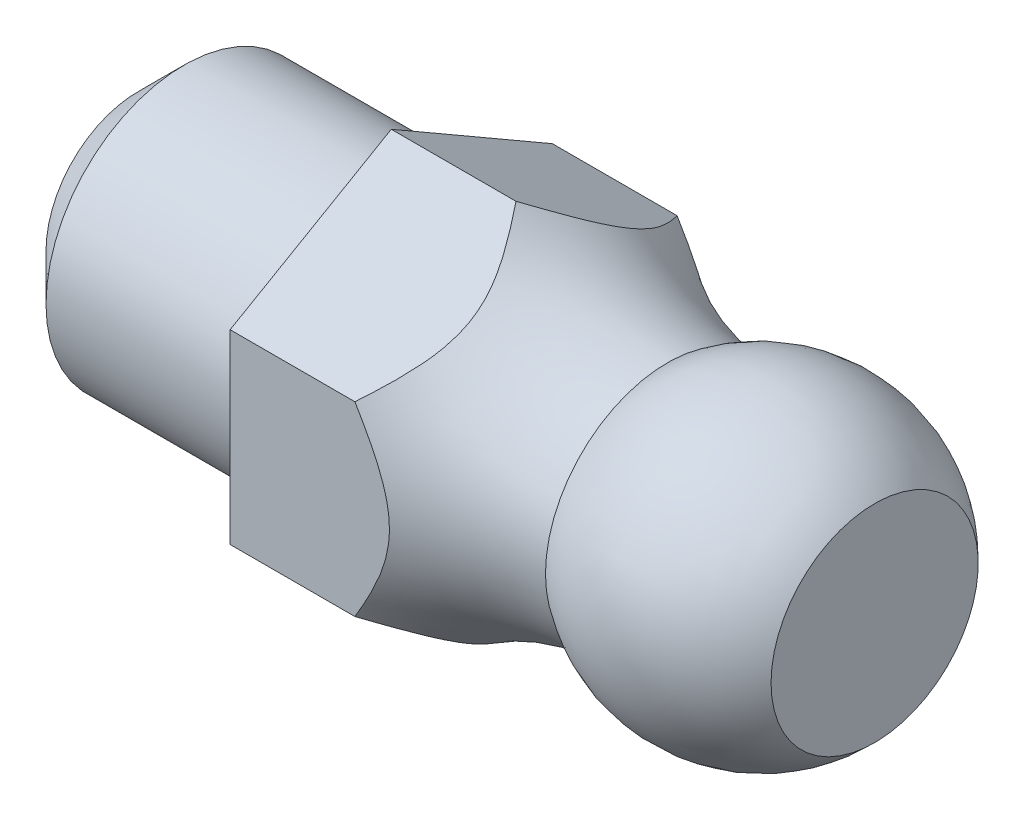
from build123d import *

# Parameters (mm, degrees)
GEWINDEFASE_SIZE                = 1
SCHL_SSELFL_CHE_SW9_R           = 4.05
SCHNITT_LINEAR_AUSTRAGEN1_DEPTH = 12.960560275


with BuildPart() as part:
    # Grundk_rper → Basis-Rotation (revolve)
    with BuildSketch(Plane.XY, mode=Mode.PRIVATE) as basis_rotation_sk:
        with BuildLine():
            Line((0, 0), (0, 3))
            Line((0, 3), (5.5, 3))
            Line((5.5, 3), (5.5, 4.05))
            Line((5.5, 4.05), (8.2, 4.05))
            ThreePointArc((8.2, 4.05), (9.743003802, 3.097794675), (11.5, 2.65))
            ThreePointArc((11.5, 2.65), (13.826069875, 3.305786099), (16, 2.25))
            Line((16, 2.25), (16, 0))
            Line((16, 0), (0, 0))
        make_face()
    revolve(basis_rotation_sk.sketch.rotate(Axis((-3.375568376, 0, 0), (1, 0, 0)), 90), axis=Axis((-3.375568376, 0, 0), (1, 0, 0)))

    # Gewindefase
    gewindefase_edges = [part.edges().sort_by_distance(p)[0] for p in [
        (0, 0, -3),
    ]]
    chamfer(gewindefase_edges, length=GEWINDEFASE_SIZE)

    # Schl_sselfl_che-SW9 → Schnitt-Linear austragen1 (cut, through all)
    with BuildSketch(Plane.ZY.offset(-5.5)):
        Circle(SCHL_SSELFL_CHE_SW9_R)
        Polygon((0, 4.041451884), (-3.5, 2.020725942), (-3.5, -2.020725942), (0, -4.041451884), (3.5, -2.020725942), (3.5, 2.020725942), align=None, mode=Mode.SUBTRACT)
    extrude(amount=-SCHNITT_LINEAR_AUSTRAGEN1_DEPTH, mode=Mode.SUBTRACT)


solid = part.part
